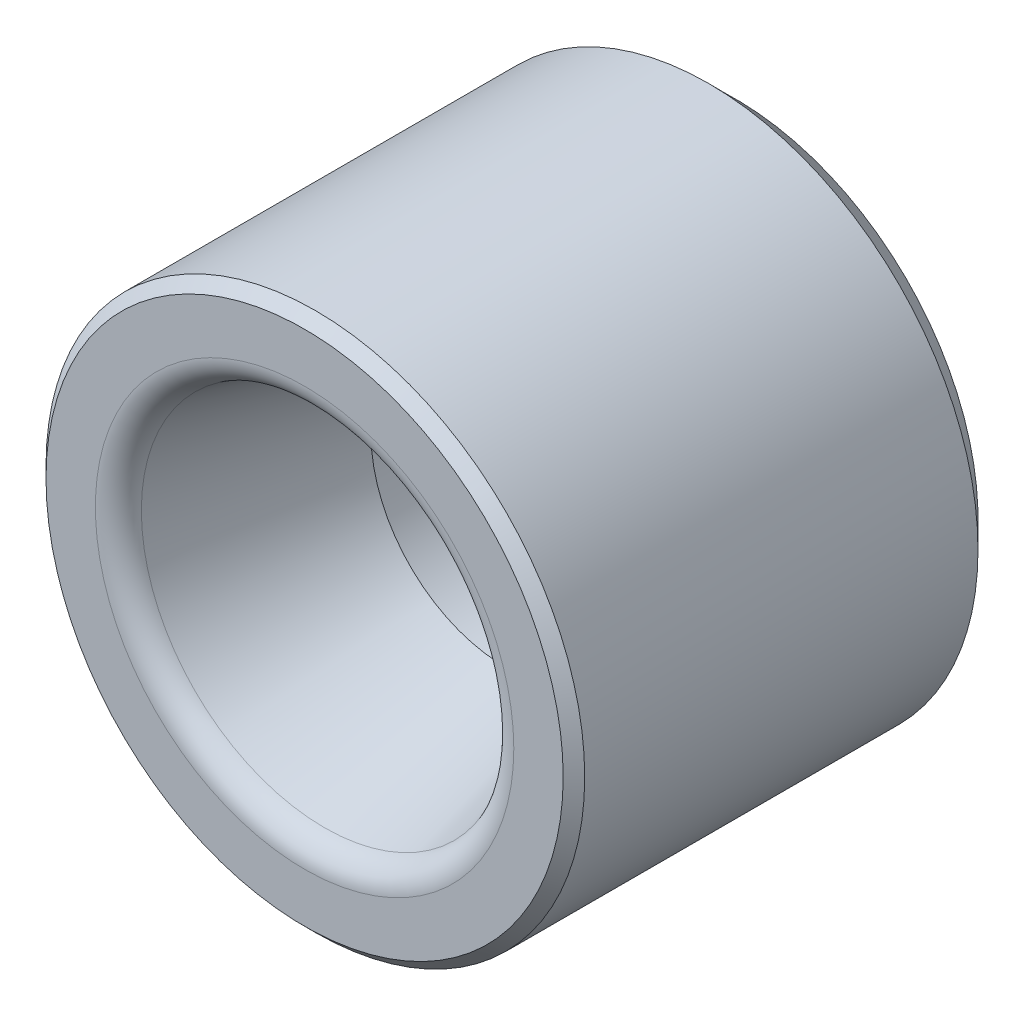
ISO-10303-21;
HEADER;
FILE_DESCRIPTION(('STEP AP214'),'2;1');
FILE_NAME('part.step','',(''),(''),'','','');
FILE_SCHEMA(('AUTOMOTIVE_DESIGN { 1 0 10303 214 1 1 1 1 }'));
ENDSEC;
DATA;
#1=APPLICATION_CONTEXT('core data for automotive mechanical design processes');
#2=APPLICATION_PROTOCOL_DEFINITION('international standard','automotive_design',2000,#1);
#3=PRODUCT_CONTEXT('',#1,'mechanical');
#4=PRODUCT('Part','Part','',(#3));
#5=PRODUCT_RELATED_PRODUCT_CATEGORY('part','',(#4));
#6=PRODUCT_DEFINITION_FORMATION('','',#4);
#7=PRODUCT_DEFINITION_CONTEXT('part definition',#1,'design');
#8=PRODUCT_DEFINITION('design','',#6,#7);
#9=PRODUCT_DEFINITION_SHAPE('','',#8);
#10=(LENGTH_UNIT() NAMED_UNIT(*) SI_UNIT(.MILLI.,.METRE.));
#11=(NAMED_UNIT(*) PLANE_ANGLE_UNIT() SI_UNIT($,.RADIAN.));
#12=(NAMED_UNIT(*) SI_UNIT($,.STERADIAN.) SOLID_ANGLE_UNIT());
#13=UNCERTAINTY_MEASURE_WITH_UNIT(LENGTH_MEASURE(1.E-05),#10,'distance_accuracy_value','');
#14=(GEOMETRIC_REPRESENTATION_CONTEXT(3) GLOBAL_UNCERTAINTY_ASSIGNED_CONTEXT((#13)) GLOBAL_UNIT_ASSIGNED_CONTEXT((#10,
#11,#12)) REPRESENTATION_CONTEXT('',''));
#15=CARTESIAN_POINT('',(0.,0.,0.));
#16=DIRECTION('',(0.,0.,1.));
#17=DIRECTION('',(1.,0.,0.));
#18=AXIS2_PLACEMENT_3D('',#15,#16,#17);
#19=CARTESIAN_POINT('',(0.,0.,8.));
#20=DIRECTION('',(0.,0.,1.));
#21=DIRECTION('',(-1.,0.,0.));
#22=AXIS2_PLACEMENT_3D('',#19,#20,#21);
#23=CONICAL_SURFACE('',#22,3.5,0.261799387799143);
#24=CARTESIAN_POINT('',(0.,0.,7.62940952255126));
#25=DIRECTION('',(0.,0.,-1.));
#26=DIRECTION('',(1.,0.,0.));
#27=AXIS2_PLACEMENT_3D('',#24,#25,#26);
#28=CIRCLE('',#27,3.40070058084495);
#29=CARTESIAN_POINT('',(3.40070058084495,0.,7.62940952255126));
#30=VERTEX_POINT('',#29);
#31=EDGE_CURVE('E36',#30,#30,#28,.F.);
#32=ORIENTED_EDGE('',*,*,#31,.T.);
#33=EDGE_LOOP('',(#32));
#34=FACE_BOUND('',#33,.T.);
#35=CARTESIAN_POINT('',(0.,0.,4.26794919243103));
#36=DIRECTION('',(0.,0.,1.));
#37=DIRECTION('',(-1.,0.,0.));
#38=AXIS2_PLACEMENT_3D('',#35,#36,#37);
#39=CIRCLE('',#38,2.5);
#40=CARTESIAN_POINT('',(-2.5,0.,4.26794919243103));
#41=VERTEX_POINT('',#40);
#42=EDGE_CURVE('E45',#41,#41,#39,.T.);
#43=ORIENTED_EDGE('',*,*,#42,.F.);
#44=EDGE_LOOP('',(#43));
#45=FACE_BOUND('',#44,.T.);
#46=ADVANCED_FACE('F12',(#34,#45),#23,.F.);
#47=CARTESIAN_POINT('',(1.35640646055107,0.,0.));
#48=DIRECTION('',(0.,0.,1.));
#49=DIRECTION('',(-1.,0.,0.));
#50=AXIS2_PLACEMENT_3D('',#47,#48,#49);
#51=PLANE('',#50);
#52=CARTESIAN_POINT('',(0.,0.,0.));
#53=DIRECTION('',(0.,0.,1.));
#54=DIRECTION('',(-1.,0.,0.));
#55=AXIS2_PLACEMENT_3D('',#52,#53,#54);
#56=CIRCLE('',#55,4.5);
#57=CARTESIAN_POINT('',(-4.5,0.,0.));
#58=VERTEX_POINT('',#57);
#59=EDGE_CURVE('E19',#58,#58,#56,.F.);
#60=ORIENTED_EDGE('',*,*,#59,.T.);
#61=EDGE_LOOP('',(#60));
#62=FACE_BOUND('',#61,.T.);
#63=CARTESIAN_POINT('',(0.,0.,0.));
#64=DIRECTION('',(0.,0.,1.));
#65=DIRECTION('',(-1.,0.,0.));
#66=AXIS2_PLACEMENT_3D('',#63,#64,#65);
#67=CIRCLE('',#66,2.35);
#68=CARTESIAN_POINT('',(-2.35,0.,0.));
#69=VERTEX_POINT('',#68);
#70=EDGE_CURVE('E23',#69,#69,#67,.T.);
#71=ORIENTED_EDGE('',*,*,#70,.T.);
#72=EDGE_LOOP('',(#71));
#73=FACE_BOUND('',#72,.T.);
#74=ADVANCED_FACE('F78',(#62,#73),#51,.F.);
#75=CARTESIAN_POINT('',(0.,0.,0.));
#76=DIRECTION('',(0.,0.,1.));
#77=DIRECTION('',(-1.,0.,0.));
#78=AXIS2_PLACEMENT_3D('',#75,#76,#77);
#79=CYLINDRICAL_SURFACE('',#78,5.);
#80=CARTESIAN_POINT('',(0.,0.,0.5));
#81=DIRECTION('',(0.,0.,1.));
#82=DIRECTION('',(-1.,0.,0.));
#83=AXIS2_PLACEMENT_3D('',#80,#81,#82);
#84=CIRCLE('',#83,5.);
#85=CARTESIAN_POINT('',(-5.,0.,0.5));
#86=VERTEX_POINT('',#85);
#87=EDGE_CURVE('E8',#86,#86,#84,.T.);
#88=ORIENTED_EDGE('',*,*,#87,.T.);
#89=EDGE_LOOP('',(#88));
#90=FACE_BOUND('',#89,.T.);
#91=CARTESIAN_POINT('',(0.,0.,7.8));
#92=DIRECTION('',(0.,0.,-1.));
#93=DIRECTION('',(1.,0.,0.));
#94=AXIS2_PLACEMENT_3D('',#91,#92,#93);
#95=CIRCLE('',#94,5.);
#96=CARTESIAN_POINT('',(5.,0.,7.8));
#97=VERTEX_POINT('',#96);
#98=EDGE_CURVE('E39',#97,#97,#95,.T.);
#99=ORIENTED_EDGE('',*,*,#98,.T.);
#100=EDGE_LOOP('',(#99));
#101=FACE_BOUND('',#100,.T.);
#102=ADVANCED_FACE('F84',(#90,#101),#79,.T.);
#103=CARTESIAN_POINT('',(3.5,0.,8.));
#104=DIRECTION('',(0.,0.,-1.));
#105=DIRECTION('',(1.,0.,0.));
#106=AXIS2_PLACEMENT_3D('',#103,#104,#105);
#107=PLANE('',#106);
#108=CARTESIAN_POINT('',(0.,0.,8.));
#109=DIRECTION('',(0.,0.,-1.));
#110=DIRECTION('',(1.,0.,0.));
#111=AXIS2_PLACEMENT_3D('',#108,#109,#110);
#112=CIRCLE('',#111,3.88366349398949);
#113=CARTESIAN_POINT('',(3.88366349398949,0.,8.));
#114=VERTEX_POINT('',#113);
#115=EDGE_CURVE('E27',#114,#114,#112,.T.);
#116=ORIENTED_EDGE('',*,*,#115,.T.);
#117=EDGE_LOOP('',(#116));
#118=FACE_BOUND('',#117,.T.);
#119=CARTESIAN_POINT('',(0.,0.,8.));
#120=DIRECTION('',(0.,0.,-1.));
#121=DIRECTION('',(1.,0.,0.));
#122=AXIS2_PLACEMENT_3D('',#119,#120,#121);
#123=CIRCLE('',#122,4.8);
#124=CARTESIAN_POINT('',(4.8,0.,8.));
#125=VERTEX_POINT('',#124);
#126=EDGE_CURVE('E42',#125,#125,#123,.F.);
#127=ORIENTED_EDGE('',*,*,#126,.T.);
#128=EDGE_LOOP('',(#127));
#129=FACE_BOUND('',#128,.T.);
#130=ADVANCED_FACE('F87',(#118,#129),#107,.F.);
#131=CARTESIAN_POINT('',(0.,0.,8.));
#132=DIRECTION('',(0.,0.,-1.));
#133=DIRECTION('',(1.,0.,0.));
#134=AXIS2_PLACEMENT_3D('',#131,#132,#133);
#135=CONICAL_SURFACE('',#134,4.8,0.785398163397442);
#136=ORIENTED_EDGE('',*,*,#98,.F.);
#137=EDGE_LOOP('',(#136));
#138=FACE_BOUND('',#137,.T.);
#139=ORIENTED_EDGE('',*,*,#126,.F.);
#140=EDGE_LOOP('',(#139));
#141=FACE_BOUND('',#140,.T.);
#142=ADVANCED_FACE('F73',(#138,#141),#135,.T.);
#143=CARTESIAN_POINT('',(0.,0.,7.5));
#144=DIRECTION('',(0.,0.,-1.));
#145=DIRECTION('',(1.,0.,0.));
#146=AXIS2_PLACEMENT_3D('',#143,#144,#145);
#147=TOROIDAL_SURFACE('',#146,3.88366349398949,0.5);
#148=ORIENTED_EDGE('',*,*,#115,.F.);
#149=EDGE_LOOP('',(#148));
#150=FACE_BOUND('',#149,.T.);
#151=ORIENTED_EDGE('',*,*,#31,.F.);
#152=EDGE_LOOP('',(#151));
#153=FACE_BOUND('',#152,.T.);
#154=ADVANCED_FACE('F66',(#150,#153),#147,.T.);
#155=CARTESIAN_POINT('',(0.,0.,0.));
#156=DIRECTION('',(0.,0.,1.));
#157=DIRECTION('',(-1.,0.,0.));
#158=AXIS2_PLACEMENT_3D('',#155,#156,#157);
#159=CYLINDRICAL_SURFACE('',#158,2.5);
#160=ORIENTED_EDGE('',*,*,#42,.T.);
#161=EDGE_LOOP('',(#160));
#162=FACE_BOUND('',#161,.T.);
#163=CARTESIAN_POINT('',(0.,0.,3.5));
#164=DIRECTION('',(0.,0.,1.));
#165=DIRECTION('',(-1.,0.,0.));
#166=AXIS2_PLACEMENT_3D('',#163,#164,#165);
#167=CIRCLE('',#166,2.5);
#168=CARTESIAN_POINT('',(-2.5,0.,3.5));
#169=VERTEX_POINT('',#168);
#170=EDGE_CURVE('E48',#169,#169,#167,.T.);
#171=ORIENTED_EDGE('',*,*,#170,.F.);
#172=EDGE_LOOP('',(#171));
#173=FACE_BOUND('',#172,.T.);
#174=ADVANCED_FACE('F61',(#162,#173),#159,.F.);
#175=CARTESIAN_POINT('',(0.,0.,2.98926847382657));
#176=DIRECTION('',(0.,0.,1.));
#177=DIRECTION('',(-1.,0.,0.));
#178=AXIS2_PLACEMENT_3D('',#175,#176,#177);
#179=CONICAL_SURFACE('',#178,1.65,1.02974425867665);
#180=CARTESIAN_POINT('',(0.,0.,3.19956969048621));
#181=DIRECTION('',(0.,0.,1.));
#182=DIRECTION('',(-1.,0.,0.));
#183=AXIS2_PLACEMENT_3D('',#180,#181,#182);
#184=CIRCLE('',#183,2.);
#185=CARTESIAN_POINT('',(-2.,0.,3.19956969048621));
#186=VERTEX_POINT('',#185);
#187=EDGE_CURVE('E32',#186,#186,#184,.T.);
#188=ORIENTED_EDGE('',*,*,#187,.F.);
#189=EDGE_LOOP('',(#188));
#190=FACE_BOUND('',#189,.T.);
#191=ORIENTED_EDGE('',*,*,#170,.T.);
#192=EDGE_LOOP('',(#191));
#193=FACE_BOUND('',#192,.T.);
#194=ADVANCED_FACE('F57',(#190,#193),#179,.F.);
#195=CARTESIAN_POINT('',(0.,0.,0.7));
#196=DIRECTION('',(0.,0.,-1.));
#197=DIRECTION('',(0.,1.,0.));
#198=AXIS2_PLACEMENT_3D('',#195,#196,#197);
#199=CONICAL_SURFACE('',#198,1.65,0.78539816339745);
#200=CARTESIAN_POINT('',(0.,0.,0.35));
#201=DIRECTION('',(0.,0.,-1.));
#202=DIRECTION('',(0.,1.,0.));
#203=AXIS2_PLACEMENT_3D('',#200,#201,#202);
#204=CIRCLE('',#203,2.);
#205=CARTESIAN_POINT('',(0.,2.,0.35));
#206=VERTEX_POINT('',#205);
#207=EDGE_CURVE('E30',#206,#206,#204,.T.);
#208=ORIENTED_EDGE('',*,*,#207,.F.);
#209=EDGE_LOOP('',(#208));
#210=FACE_BOUND('',#209,.T.);
#211=ORIENTED_EDGE('',*,*,#70,.F.);
#212=EDGE_LOOP('',(#211));
#213=FACE_BOUND('',#212,.T.);
#214=ADVANCED_FACE('F60',(#210,#213),#199,.F.);
#215=CARTESIAN_POINT('',(0.,0.,10.));
#216=DIRECTION('',(0.,0.,-1.));
#217=DIRECTION('',(1.,0.,0.));
#218=AXIS2_PLACEMENT_3D('',#215,#216,#217);
#219=CYLINDRICAL_SURFACE('',#218,2.);
#220=ORIENTED_EDGE('',*,*,#187,.T.);
#221=EDGE_LOOP('',(#220));
#222=FACE_BOUND('',#221,.T.);
#223=ORIENTED_EDGE('',*,*,#207,.T.);
#224=EDGE_LOOP('',(#223));
#225=FACE_BOUND('',#224,.T.);
#226=ADVANCED_FACE('F54',(#222,#225),#219,.F.);
#227=CARTESIAN_POINT('',(0.,0.,0.));
#228=DIRECTION('',(0.,0.,1.));
#229=DIRECTION('',(-1.,0.,0.));
#230=AXIS2_PLACEMENT_3D('',#227,#228,#229);
#231=CONICAL_SURFACE('',#230,4.5,0.785398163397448);
#232=ORIENTED_EDGE('',*,*,#87,.F.);
#233=EDGE_LOOP('',(#232));
#234=FACE_BOUND('',#233,.T.);
#235=ORIENTED_EDGE('',*,*,#59,.F.);
#236=EDGE_LOOP('',(#235));
#237=FACE_BOUND('',#236,.T.);
#238=ADVANCED_FACE('F14',(#234,#237),#231,.T.);
#239=CLOSED_SHELL('',(#46,#74,#102,#130,#142,#154,#174,#194,#214,#226,#238));
#240=MANIFOLD_SOLID_BREP('B1',#239);
#241=ADVANCED_BREP_SHAPE_REPRESENTATION('',(#18,#240),#14);
#242=SHAPE_DEFINITION_REPRESENTATION(#9,#241);
ENDSEC;
END-ISO-10303-21;
